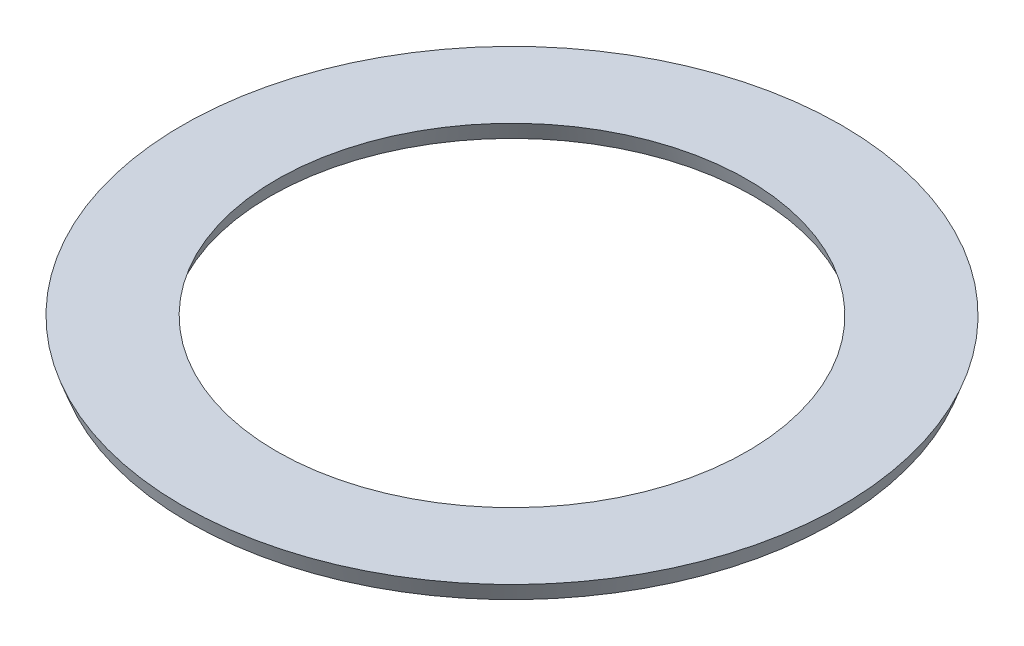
ISO-10303-21;
HEADER;
FILE_DESCRIPTION(('STEP AP214'),'2;1');
FILE_NAME('part.step','',(''),(''),'','','');
FILE_SCHEMA(('AUTOMOTIVE_DESIGN { 1 0 10303 214 1 1 1 1 }'));
ENDSEC;
DATA;
#1=APPLICATION_CONTEXT('core data for automotive mechanical design processes');
#2=APPLICATION_PROTOCOL_DEFINITION('international standard','automotive_design',2000,#1);
#3=PRODUCT_CONTEXT('',#1,'mechanical');
#4=PRODUCT('Part','Part','',(#3));
#5=PRODUCT_RELATED_PRODUCT_CATEGORY('part','',(#4));
#6=PRODUCT_DEFINITION_FORMATION('','',#4);
#7=PRODUCT_DEFINITION_CONTEXT('part definition',#1,'design');
#8=PRODUCT_DEFINITION('design','',#6,#7);
#9=PRODUCT_DEFINITION_SHAPE('','',#8);
#10=(LENGTH_UNIT() NAMED_UNIT(*) SI_UNIT(.MILLI.,.METRE.));
#11=(NAMED_UNIT(*) PLANE_ANGLE_UNIT() SI_UNIT($,.RADIAN.));
#12=(NAMED_UNIT(*) SI_UNIT($,.STERADIAN.) SOLID_ANGLE_UNIT());
#13=UNCERTAINTY_MEASURE_WITH_UNIT(LENGTH_MEASURE(1.E-05),#10,'distance_accuracy_value','');
#14=(GEOMETRIC_REPRESENTATION_CONTEXT(3) GLOBAL_UNCERTAINTY_ASSIGNED_CONTEXT((#13)) GLOBAL_UNIT_ASSIGNED_CONTEXT((#10,
#11,#12)) REPRESENTATION_CONTEXT('',''));
#15=CARTESIAN_POINT('',(0.,0.,0.));
#16=DIRECTION('',(0.,0.,1.));
#17=DIRECTION('',(1.,0.,0.));
#18=AXIS2_PLACEMENT_3D('',#15,#16,#17);
#19=CARTESIAN_POINT('',(0.,-1.5,0.));
#20=DIRECTION('',(0.,-1.,0.));
#21=DIRECTION('',(0.,0.,-1.));
#22=AXIS2_PLACEMENT_3D('',#19,#20,#21);
#23=CONICAL_SURFACE('',#22,20.5459553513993,0.349065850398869);
#24=CARTESIAN_POINT('',(0.,0.,0.));
#25=DIRECTION('',(0.,1.,0.));
#26=DIRECTION('',(0.,0.,1.));
#27=AXIS2_PLACEMENT_3D('',#24,#25,#26);
#28=CIRCLE('',#27,20.);
#29=CARTESIAN_POINT('',(0.,0.,20.));
#30=VERTEX_POINT('',#29);
#31=EDGE_CURVE('E10',#30,#30,#28,.T.);
#32=ORIENTED_EDGE('',*,*,#31,.T.);
#33=EDGE_LOOP('',(#32));
#34=FACE_BOUND('',#33,.T.);
#35=CARTESIAN_POINT('',(0.,-1.5,0.));
#36=DIRECTION('',(0.,1.,0.));
#37=DIRECTION('',(0.,0.,1.));
#38=AXIS2_PLACEMENT_3D('',#35,#36,#37);
#39=CIRCLE('',#38,20.5459553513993);
#40=CARTESIAN_POINT('',(0.,-1.5,20.5459553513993));
#41=VERTEX_POINT('',#40);
#42=EDGE_CURVE('E38',#41,#41,#39,.T.);
#43=ORIENTED_EDGE('',*,*,#42,.F.);
#44=EDGE_LOOP('',(#43));
#45=FACE_BOUND('',#44,.T.);
#46=ADVANCED_FACE('F24',(#34,#45),#23,.F.);
#47=CARTESIAN_POINT('',(-20.,0.,0.));
#48=DIRECTION('',(0.,1.,0.));
#49=DIRECTION('',(0.,0.,1.));
#50=AXIS2_PLACEMENT_3D('',#47,#48,#49);
#51=PLANE('',#50);
#52=CARTESIAN_POINT('',(0.,0.,0.));
#53=DIRECTION('',(0.,1.,0.));
#54=DIRECTION('',(0.,0.,1.));
#55=AXIS2_PLACEMENT_3D('',#52,#53,#54);
#56=CIRCLE('',#55,28.);
#57=CARTESIAN_POINT('',(0.,0.,28.));
#58=VERTEX_POINT('',#57);
#59=EDGE_CURVE('E30',#58,#58,#56,.T.);
#60=ORIENTED_EDGE('',*,*,#59,.T.);
#61=EDGE_LOOP('',(#60));
#62=FACE_BOUND('',#61,.T.);
#63=ORIENTED_EDGE('',*,*,#31,.F.);
#64=EDGE_LOOP('',(#63));
#65=FACE_BOUND('',#64,.T.);
#66=ADVANCED_FACE('F48',(#62,#65),#51,.T.);
#67=CARTESIAN_POINT('',(0.,0.,0.));
#68=DIRECTION('',(0.,1.,0.));
#69=DIRECTION('',(0.,0.,1.));
#70=AXIS2_PLACEMENT_3D('',#67,#68,#69);
#71=CONICAL_SURFACE('',#70,28.,0.349065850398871);
#72=CARTESIAN_POINT('',(0.,-1.5,0.));
#73=DIRECTION('',(0.,1.,0.));
#74=DIRECTION('',(0.,0.,1.));
#75=AXIS2_PLACEMENT_3D('',#72,#73,#74);
#76=CIRCLE('',#75,27.4540446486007);
#77=CARTESIAN_POINT('',(0.,-1.5,27.4540446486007));
#78=VERTEX_POINT('',#77);
#79=EDGE_CURVE('E34',#78,#78,#76,.T.);
#80=ORIENTED_EDGE('',*,*,#79,.T.);
#81=EDGE_LOOP('',(#80));
#82=FACE_BOUND('',#81,.T.);
#83=ORIENTED_EDGE('',*,*,#59,.F.);
#84=EDGE_LOOP('',(#83));
#85=FACE_BOUND('',#84,.T.);
#86=ADVANCED_FACE('F52',(#82,#85),#71,.T.);
#87=CARTESIAN_POINT('',(-27.4540446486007,-1.5,0.));
#88=DIRECTION('',(0.,-1.,0.));
#89=DIRECTION('',(0.,0.,-1.));
#90=AXIS2_PLACEMENT_3D('',#87,#88,#89);
#91=PLANE('',#90);
#92=ORIENTED_EDGE('',*,*,#42,.T.);
#93=EDGE_LOOP('',(#92));
#94=FACE_BOUND('',#93,.T.);
#95=ORIENTED_EDGE('',*,*,#79,.F.);
#96=EDGE_LOOP('',(#95));
#97=FACE_BOUND('',#96,.T.);
#98=ADVANCED_FACE('F44',(#94,#97),#91,.T.);
#99=CLOSED_SHELL('',(#46,#66,#86,#98));
#100=MANIFOLD_SOLID_BREP('B2',#99);
#101=ADVANCED_BREP_SHAPE_REPRESENTATION('',(#18,#100),#14);
#102=SHAPE_DEFINITION_REPRESENTATION(#9,#101);
ENDSEC;
END-ISO-10303-21;
